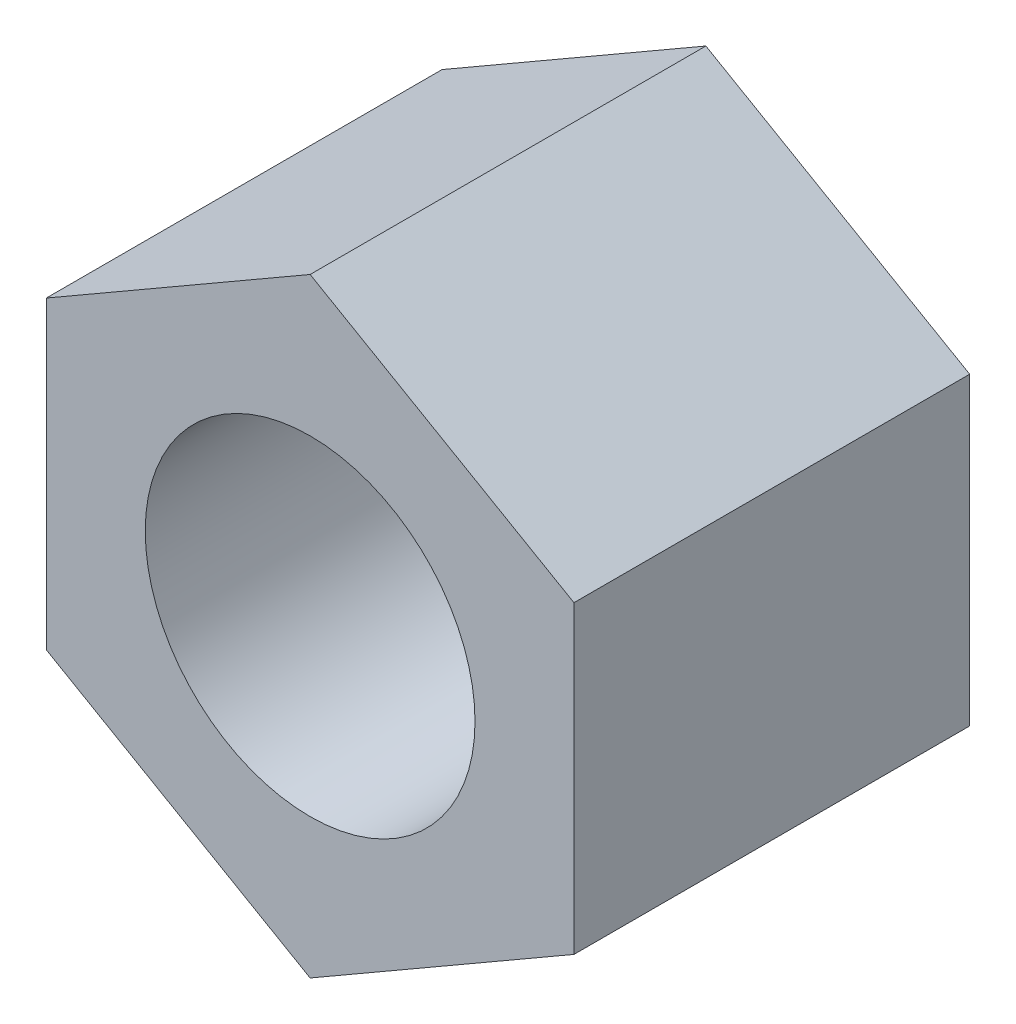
ISO-10303-21;
HEADER;
FILE_DESCRIPTION(('STEP AP214'),'2;1');
FILE_NAME('part.step','',(''),(''),'','','');
FILE_SCHEMA(('AUTOMOTIVE_DESIGN { 1 0 10303 214 1 1 1 1 }'));
ENDSEC;
DATA;
#1=APPLICATION_CONTEXT('core data for automotive mechanical design processes');
#2=APPLICATION_PROTOCOL_DEFINITION('international standard','automotive_design',2000,#1);
#3=PRODUCT_CONTEXT('',#1,'mechanical');
#4=PRODUCT('Part','Part','',(#3));
#5=PRODUCT_RELATED_PRODUCT_CATEGORY('part','',(#4));
#6=PRODUCT_DEFINITION_FORMATION('','',#4);
#7=PRODUCT_DEFINITION_CONTEXT('part definition',#1,'design');
#8=PRODUCT_DEFINITION('design','',#6,#7);
#9=PRODUCT_DEFINITION_SHAPE('','',#8);
#10=(LENGTH_UNIT() NAMED_UNIT(*) SI_UNIT(.MILLI.,.METRE.));
#11=(NAMED_UNIT(*) PLANE_ANGLE_UNIT() SI_UNIT($,.RADIAN.));
#12=(NAMED_UNIT(*) SI_UNIT($,.STERADIAN.) SOLID_ANGLE_UNIT());
#13=UNCERTAINTY_MEASURE_WITH_UNIT(LENGTH_MEASURE(1.E-05),#10,'distance_accuracy_value','');
#14=(GEOMETRIC_REPRESENTATION_CONTEXT(3) GLOBAL_UNCERTAINTY_ASSIGNED_CONTEXT((#13)) GLOBAL_UNIT_ASSIGNED_CONTEXT((#10,
#11,#12)) REPRESENTATION_CONTEXT('',''));
#15=CARTESIAN_POINT('',(0.,0.,0.));
#16=DIRECTION('',(0.,0.,1.));
#17=DIRECTION('',(1.,0.,0.));
#18=AXIS2_PLACEMENT_3D('',#15,#16,#17);
#19=CARTESIAN_POINT('',(0.,4.618802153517,18.2202018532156));
#20=DIRECTION('',(0.5,-0.866025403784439,0.));
#21=DIRECTION('',(0.866025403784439,0.5,0.));
#22=AXIS2_PLACEMENT_3D('',#19,#20,#21);
#23=PLANE('',#22);
#24=DIRECTION('',(-0.866025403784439,-0.5,0.));
#25=VECTOR('',#24,1.);
#26=CARTESIAN_POINT('',(0.,4.618802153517,6.));
#27=LINE('',#26,#25);
#28=CARTESIAN_POINT('',(0.,4.618802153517,6.));
#29=VERTEX_POINT('',#28);
#30=CARTESIAN_POINT('',(-4.,2.3094010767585,6.));
#31=VERTEX_POINT('',#30);
#32=EDGE_CURVE('E80',#29,#31,#27,.T.);
#33=ORIENTED_EDGE('',*,*,#32,.F.);
#34=DIRECTION('',(0.,0.,-1.));
#35=VECTOR('',#34,1.);
#36=CARTESIAN_POINT('',(0.,4.618802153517,18.2202018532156));
#37=LINE('',#36,#35);
#38=CARTESIAN_POINT('',(0.,4.618802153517,0.));
#39=VERTEX_POINT('',#38);
#40=EDGE_CURVE('E40',#29,#39,#37,.T.);
#41=ORIENTED_EDGE('',*,*,#40,.T.);
#42=DIRECTION('',(-0.866025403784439,-0.5,0.));
#43=VECTOR('',#42,1.);
#44=CARTESIAN_POINT('',(0.,4.618802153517,0.));
#45=LINE('',#44,#43);
#46=CARTESIAN_POINT('',(-4.,2.3094010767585,0.));
#47=VERTEX_POINT('',#46);
#48=EDGE_CURVE('E83',#39,#47,#45,.T.);
#49=ORIENTED_EDGE('',*,*,#48,.T.);
#50=DIRECTION('',(0.,0.,-1.));
#51=VECTOR('',#50,1.);
#52=CARTESIAN_POINT('',(-4.,2.3094010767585,18.2202018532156));
#53=LINE('',#52,#51);
#54=EDGE_CURVE('E77',#31,#47,#53,.T.);
#55=ORIENTED_EDGE('',*,*,#54,.F.);
#56=EDGE_LOOP('',(#33,#41,#49,#55));
#57=FACE_BOUND('',#56,.T.);
#58=ADVANCED_FACE('F24',(#57),#23,.F.);
#59=CARTESIAN_POINT('',(4.,2.3094010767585,18.2202018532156));
#60=DIRECTION('',(-0.5,-0.866025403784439,0.));
#61=DIRECTION('',(0.866025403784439,-0.5,0.));
#62=AXIS2_PLACEMENT_3D('',#59,#60,#61);
#63=PLANE('',#62);
#64=DIRECTION('',(-0.866025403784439,0.5,0.));
#65=VECTOR('',#64,1.);
#66=CARTESIAN_POINT('',(4.,2.3094010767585,6.));
#67=LINE('',#66,#65);
#68=CARTESIAN_POINT('',(4.,2.3094010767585,6.));
#69=VERTEX_POINT('',#68);
#70=EDGE_CURVE('E95',#69,#29,#67,.T.);
#71=ORIENTED_EDGE('',*,*,#70,.F.);
#72=DIRECTION('',(0.,0.,-1.));
#73=VECTOR('',#72,1.);
#74=CARTESIAN_POINT('',(4.,2.3094010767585,18.2202018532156));
#75=LINE('',#74,#73);
#76=CARTESIAN_POINT('',(4.,2.3094010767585,0.));
#77=VERTEX_POINT('',#76);
#78=EDGE_CURVE('E123',#69,#77,#75,.T.);
#79=ORIENTED_EDGE('',*,*,#78,.T.);
#80=DIRECTION('',(-0.866025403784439,0.5,0.));
#81=VECTOR('',#80,1.);
#82=CARTESIAN_POINT('',(4.,2.3094010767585,0.));
#83=LINE('',#82,#81);
#84=EDGE_CURVE('E119',#77,#39,#83,.T.);
#85=ORIENTED_EDGE('',*,*,#84,.T.);
#86=ORIENTED_EDGE('',*,*,#40,.F.);
#87=EDGE_LOOP('',(#71,#79,#85,#86));
#88=FACE_BOUND('',#87,.T.);
#89=ADVANCED_FACE('F141',(#88),#63,.F.);
#90=CARTESIAN_POINT('',(4.,-2.3094010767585,18.2202018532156));
#91=DIRECTION('',(-1.,0.,0.));
#92=DIRECTION('',(0.,-1.,0.));
#93=AXIS2_PLACEMENT_3D('',#90,#91,#92);
#94=PLANE('',#93);
#95=DIRECTION('',(0.,1.,0.));
#96=VECTOR('',#95,1.);
#97=CARTESIAN_POINT('',(4.,-2.3094010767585,6.));
#98=LINE('',#97,#96);
#99=CARTESIAN_POINT('',(4.,-2.3094010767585,6.));
#100=VERTEX_POINT('',#99);
#101=EDGE_CURVE('E97',#100,#69,#98,.T.);
#102=ORIENTED_EDGE('',*,*,#101,.F.);
#103=DIRECTION('',(0.,0.,-1.));
#104=VECTOR('',#103,1.);
#105=CARTESIAN_POINT('',(4.,-2.3094010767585,18.2202018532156));
#106=LINE('',#105,#104);
#107=CARTESIAN_POINT('',(4.,-2.3094010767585,0.));
#108=VERTEX_POINT('',#107);
#109=EDGE_CURVE('E125',#100,#108,#106,.T.);
#110=ORIENTED_EDGE('',*,*,#109,.T.);
#111=DIRECTION('',(0.,1.,0.));
#112=VECTOR('',#111,1.);
#113=CARTESIAN_POINT('',(4.,-2.3094010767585,0.));
#114=LINE('',#113,#112);
#115=EDGE_CURVE('E116',#108,#77,#114,.T.);
#116=ORIENTED_EDGE('',*,*,#115,.T.);
#117=ORIENTED_EDGE('',*,*,#78,.F.);
#118=EDGE_LOOP('',(#102,#110,#116,#117));
#119=FACE_BOUND('',#118,.T.);
#120=ADVANCED_FACE('F140',(#119),#94,.F.);
#121=CARTESIAN_POINT('',(0.,-4.61880215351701,18.2202018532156));
#122=DIRECTION('',(-0.5,0.866025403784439,0.));
#123=DIRECTION('',(-0.866025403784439,-0.5,0.));
#124=AXIS2_PLACEMENT_3D('',#121,#122,#123);
#125=PLANE('',#124);
#126=DIRECTION('',(0.866025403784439,0.5,0.));
#127=VECTOR('',#126,1.);
#128=CARTESIAN_POINT('',(0.,-4.61880215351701,6.));
#129=LINE('',#128,#127);
#130=CARTESIAN_POINT('',(0.,-4.61880215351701,6.));
#131=VERTEX_POINT('',#130);
#132=EDGE_CURVE('E102',#131,#100,#129,.T.);
#133=ORIENTED_EDGE('',*,*,#132,.F.);
#134=DIRECTION('',(0.,0.,-1.));
#135=VECTOR('',#134,1.);
#136=CARTESIAN_POINT('',(0.,-4.61880215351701,18.2202018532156));
#137=LINE('',#136,#135);
#138=CARTESIAN_POINT('',(0.,-4.61880215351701,0.));
#139=VERTEX_POINT('',#138);
#140=EDGE_CURVE('E33',#131,#139,#137,.T.);
#141=ORIENTED_EDGE('',*,*,#140,.T.);
#142=DIRECTION('',(0.866025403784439,0.5,0.));
#143=VECTOR('',#142,1.);
#144=CARTESIAN_POINT('',(0.,-4.61880215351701,0.));
#145=LINE('',#144,#143);
#146=EDGE_CURVE('E113',#139,#108,#145,.T.);
#147=ORIENTED_EDGE('',*,*,#146,.T.);
#148=ORIENTED_EDGE('',*,*,#109,.F.);
#149=EDGE_LOOP('',(#133,#141,#147,#148));
#150=FACE_BOUND('',#149,.T.);
#151=ADVANCED_FACE('F128',(#150),#125,.F.);
#152=CARTESIAN_POINT('',(-4.,-2.30940107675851,18.2202018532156));
#153=DIRECTION('',(0.5,0.866025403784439,0.));
#154=DIRECTION('',(-0.866025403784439,0.5,0.));
#155=AXIS2_PLACEMENT_3D('',#152,#153,#154);
#156=PLANE('',#155);
#157=DIRECTION('',(0.866025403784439,-0.5,0.));
#158=VECTOR('',#157,1.);
#159=CARTESIAN_POINT('',(-4.,-2.30940107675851,6.));
#160=LINE('',#159,#158);
#161=CARTESIAN_POINT('',(-4.,-2.30940107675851,6.));
#162=VERTEX_POINT('',#161);
#163=EDGE_CURVE('E47',#162,#131,#160,.T.);
#164=ORIENTED_EDGE('',*,*,#163,.F.);
#165=DIRECTION('',(0.,0.,-1.));
#166=VECTOR('',#165,1.);
#167=CARTESIAN_POINT('',(-4.,-2.30940107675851,18.2202018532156));
#168=LINE('',#167,#166);
#169=CARTESIAN_POINT('',(-4.,-2.30940107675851,0.));
#170=VERTEX_POINT('',#169);
#171=EDGE_CURVE('E11',#162,#170,#168,.T.);
#172=ORIENTED_EDGE('',*,*,#171,.T.);
#173=DIRECTION('',(0.866025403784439,-0.5,0.));
#174=VECTOR('',#173,1.);
#175=CARTESIAN_POINT('',(-4.,-2.30940107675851,0.));
#176=LINE('',#175,#174);
#177=EDGE_CURVE('E110',#170,#139,#176,.T.);
#178=ORIENTED_EDGE('',*,*,#177,.T.);
#179=ORIENTED_EDGE('',*,*,#140,.F.);
#180=EDGE_LOOP('',(#164,#172,#178,#179));
#181=FACE_BOUND('',#180,.T.);
#182=ADVANCED_FACE('F133',(#181),#156,.F.);
#183=CARTESIAN_POINT('',(-4.,2.3094010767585,18.2202018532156));
#184=DIRECTION('',(1.,0.,0.));
#185=DIRECTION('',(0.,0.,-1.));
#186=AXIS2_PLACEMENT_3D('',#183,#184,#185);
#187=PLANE('',#186);
#188=DIRECTION('',(0.,-1.,0.));
#189=VECTOR('',#188,1.);
#190=CARTESIAN_POINT('',(-4.,2.3094010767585,6.));
#191=LINE('',#190,#189);
#192=EDGE_CURVE('E89',#31,#162,#191,.T.);
#193=ORIENTED_EDGE('',*,*,#192,.F.);
#194=ORIENTED_EDGE('',*,*,#54,.T.);
#195=DIRECTION('',(0.,-1.,0.));
#196=VECTOR('',#195,1.);
#197=CARTESIAN_POINT('',(-4.,2.3094010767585,0.));
#198=LINE('',#197,#196);
#199=EDGE_CURVE('E108',#47,#170,#198,.T.);
#200=ORIENTED_EDGE('',*,*,#199,.T.);
#201=ORIENTED_EDGE('',*,*,#171,.F.);
#202=EDGE_LOOP('',(#193,#194,#200,#201));
#203=FACE_BOUND('',#202,.T.);
#204=ADVANCED_FACE('F26',(#203),#187,.F.);
#205=CARTESIAN_POINT('',(-4.,6.9282032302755,0.));
#206=DIRECTION('',(0.,0.,-1.));
#207=DIRECTION('',(-1.,0.,0.));
#208=AXIS2_PLACEMENT_3D('',#205,#206,#207);
#209=PLANE('',#208);
#210=ORIENTED_EDGE('',*,*,#199,.F.);
#211=ORIENTED_EDGE('',*,*,#48,.F.);
#212=ORIENTED_EDGE('',*,*,#84,.F.);
#213=ORIENTED_EDGE('',*,*,#115,.F.);
#214=ORIENTED_EDGE('',*,*,#146,.F.);
#215=ORIENTED_EDGE('',*,*,#177,.F.);
#216=EDGE_LOOP('',(#210,#211,#212,#213,#214,#215));
#217=FACE_BOUND('',#216,.T.);
#218=CARTESIAN_POINT('',(0.,0.,0.));
#219=DIRECTION('',(0.,0.,1.));
#220=DIRECTION('',(1.,0.,0.));
#221=AXIS2_PLACEMENT_3D('',#218,#219,#220);
#222=CIRCLE('',#221,2.5);
#223=CARTESIAN_POINT('',(2.5,0.,0.));
#224=VERTEX_POINT('',#223);
#225=EDGE_CURVE('E91',#224,#224,#222,.T.);
#226=ORIENTED_EDGE('',*,*,#225,.T.);
#227=EDGE_LOOP('',(#226));
#228=FACE_BOUND('',#227,.T.);
#229=ADVANCED_FACE('F135',(#217,#228),#209,.T.);
#230=CARTESIAN_POINT('',(0.,0.,18.2202018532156));
#231=DIRECTION('',(0.,0.,-1.));
#232=DIRECTION('',(-1.,0.,0.));
#233=AXIS2_PLACEMENT_3D('',#230,#231,#232);
#234=CYLINDRICAL_SURFACE('',#233,2.5);
#235=ORIENTED_EDGE('',*,*,#225,.F.);
#236=EDGE_LOOP('',(#235));
#237=FACE_BOUND('',#236,.T.);
#238=CARTESIAN_POINT('',(0.,0.,6.));
#239=DIRECTION('',(0.,0.,1.));
#240=DIRECTION('',(1.,0.,0.));
#241=AXIS2_PLACEMENT_3D('',#238,#239,#240);
#242=CIRCLE('',#241,2.5);
#243=CARTESIAN_POINT('',(2.5,0.,6.));
#244=VERTEX_POINT('',#243);
#245=EDGE_CURVE('E28',#244,#244,#242,.T.);
#246=ORIENTED_EDGE('',*,*,#245,.T.);
#247=EDGE_LOOP('',(#246));
#248=FACE_BOUND('',#247,.T.);
#249=ADVANCED_FACE('F160',(#237,#248),#234,.F.);
#250=CARTESIAN_POINT('',(-4.,-2.3094010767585,6.));
#251=DIRECTION('',(0.,0.,1.));
#252=DIRECTION('',(0.866025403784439,-0.5,0.));
#253=AXIS2_PLACEMENT_3D('',#250,#251,#252);
#254=PLANE('',#253);
#255=ORIENTED_EDGE('',*,*,#245,.F.);
#256=EDGE_LOOP('',(#255));
#257=FACE_BOUND('',#256,.T.);
#258=ORIENTED_EDGE('',*,*,#32,.T.);
#259=ORIENTED_EDGE('',*,*,#192,.T.);
#260=ORIENTED_EDGE('',*,*,#163,.T.);
#261=ORIENTED_EDGE('',*,*,#132,.T.);
#262=ORIENTED_EDGE('',*,*,#101,.T.);
#263=ORIENTED_EDGE('',*,*,#70,.T.);
#264=EDGE_LOOP('',(#258,#259,#260,#261,#262,#263));
#265=FACE_BOUND('',#264,.T.);
#266=ADVANCED_FACE('F93',(#257,#265),#254,.T.);
#267=CLOSED_SHELL('',(#58,#89,#120,#151,#182,#204,#229,#249,#266));
#268=MANIFOLD_SOLID_BREP('B2',#267);
#269=ADVANCED_BREP_SHAPE_REPRESENTATION('',(#18,#268),#14);
#270=SHAPE_DEFINITION_REPRESENTATION(#9,#269);
ENDSEC;
END-ISO-10303-21;
